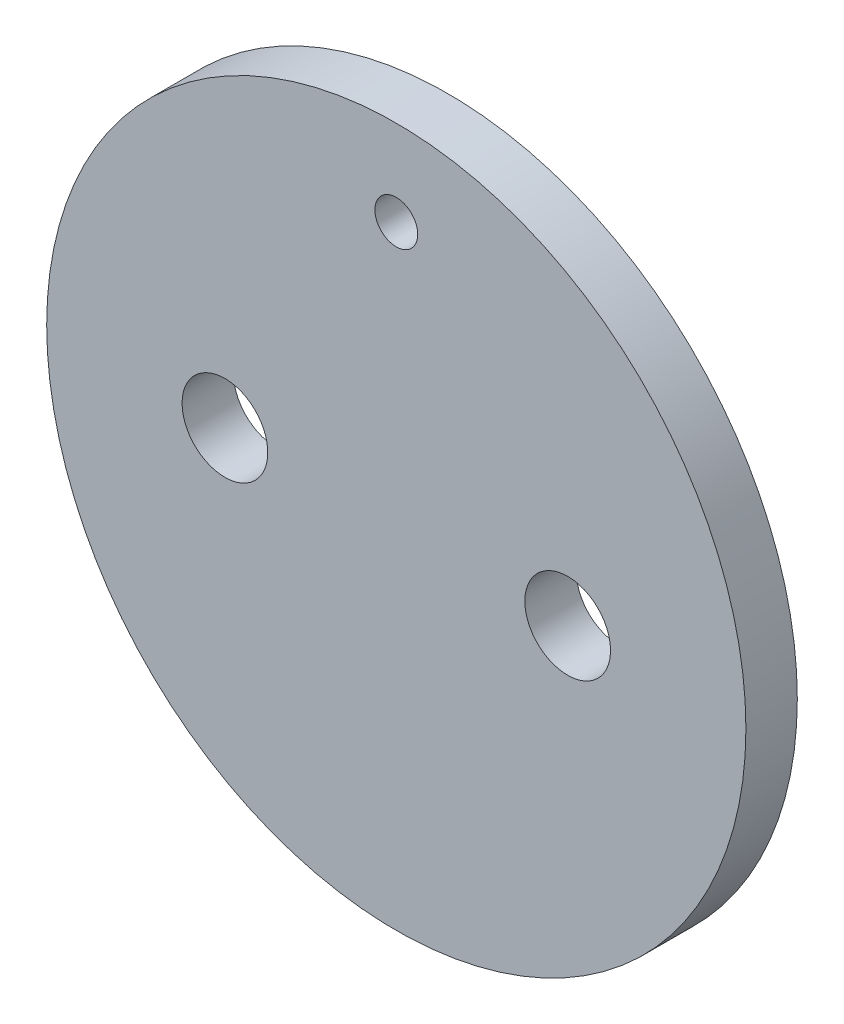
from build123d import *

# Parameters (mm, degrees)
SKETCH1_R          = 25.908
EXTRUDE1_DEPTH     = 3.81
SKETCH2_R          = 1.5875
SKETCH2_R_2        = 3.175
CUT_EXTRUDE1_DEPTH = 37.83700623


with BuildPart() as part:
    # Sketch1 → Extrude1 (new body)
    with BuildSketch(Plane.XY):
        with Locations(Location((0, 0, 0), (0, 0, 180))):
            Circle(SKETCH1_R)
    extrude(amount=EXTRUDE1_DEPTH)

    # Sketch2 → Cut-Extrude1 (cut, through all)
    with BuildSketch(Plane.XY):
        with Locations(Location((0, 19.558, 0), (0, 0, 180))):
            Circle(SKETCH2_R)
        with Locations(Location((12.7, 0, 0), (0, 0, 180))):
            Circle(SKETCH2_R_2)
        with Locations(Location((-12.7, 0, 0), (0, 0, 180))):
            Circle(SKETCH2_R_2)
    extrude(amount=CUT_EXTRUDE1_DEPTH, mode=Mode.SUBTRACT)


solid = part.part
